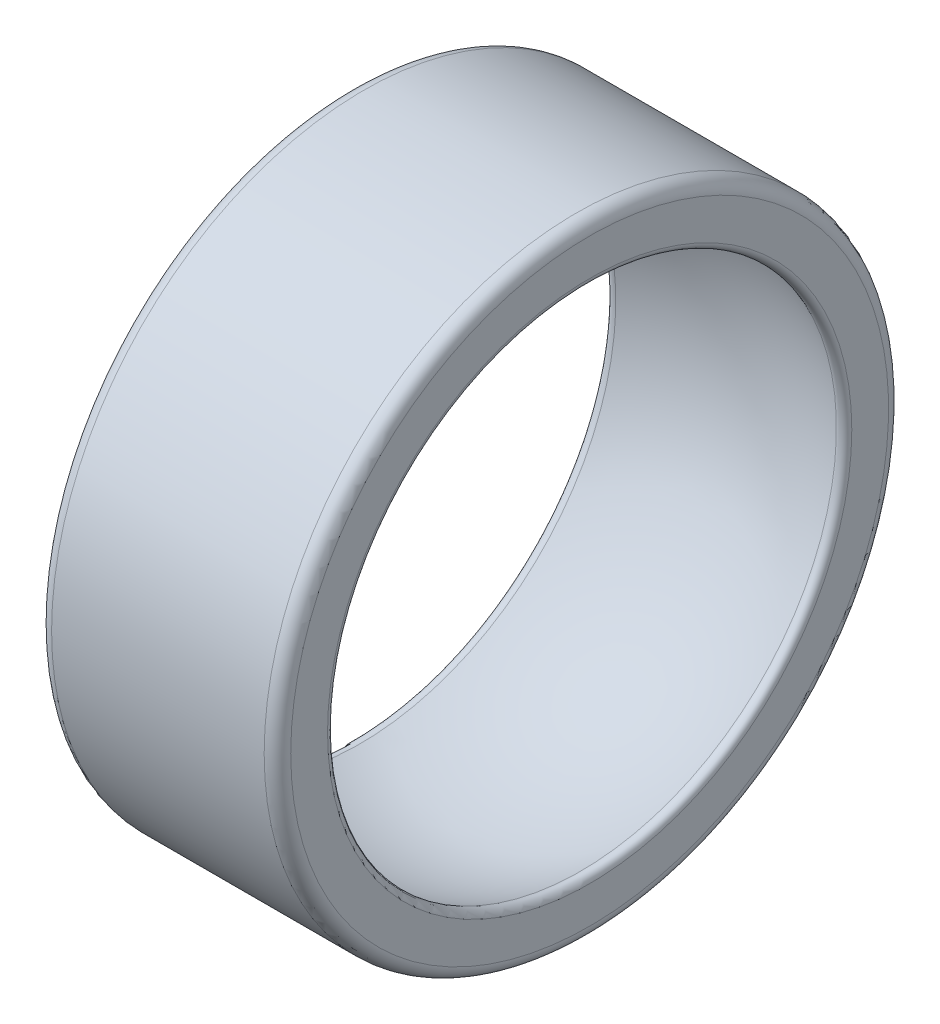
ISO-10303-21;
HEADER;
FILE_DESCRIPTION(('STEP AP214'),'2;1');
FILE_NAME('part.step','',(''),(''),'','','');
FILE_SCHEMA(('AUTOMOTIVE_DESIGN { 1 0 10303 214 1 1 1 1 }'));
ENDSEC;
DATA;
#1=APPLICATION_CONTEXT('core data for automotive mechanical design processes');
#2=APPLICATION_PROTOCOL_DEFINITION('international standard','automotive_design',2000,#1);
#3=PRODUCT_CONTEXT('',#1,'mechanical');
#4=PRODUCT('Part','Part','',(#3));
#5=PRODUCT_RELATED_PRODUCT_CATEGORY('part','',(#4));
#6=PRODUCT_DEFINITION_FORMATION('','',#4);
#7=PRODUCT_DEFINITION_CONTEXT('part definition',#1,'design');
#8=PRODUCT_DEFINITION('design','',#6,#7);
#9=PRODUCT_DEFINITION_SHAPE('','',#8);
#10=(LENGTH_UNIT() NAMED_UNIT(*) SI_UNIT(.MILLI.,.METRE.));
#11=(NAMED_UNIT(*) PLANE_ANGLE_UNIT() SI_UNIT($,.RADIAN.));
#12=(NAMED_UNIT(*) SI_UNIT($,.STERADIAN.) SOLID_ANGLE_UNIT());
#13=UNCERTAINTY_MEASURE_WITH_UNIT(LENGTH_MEASURE(1.E-05),#10,'distance_accuracy_value','');
#14=(GEOMETRIC_REPRESENTATION_CONTEXT(3) GLOBAL_UNCERTAINTY_ASSIGNED_CONTEXT((#13)) GLOBAL_UNIT_ASSIGNED_CONTEXT((#10,
#11,#12)) REPRESENTATION_CONTEXT('',''));
#15=CARTESIAN_POINT('',(0.,0.,0.));
#16=DIRECTION('',(0.,0.,1.));
#17=DIRECTION('',(1.,0.,0.));
#18=AXIS2_PLACEMENT_3D('',#15,#16,#17);
#19=CARTESIAN_POINT('',(1.,0.,0.));
#20=DIRECTION('',(-1.,0.,0.));
#21=DIRECTION('',(0.,0.,1.));
#22=AXIS2_PLACEMENT_3D('',#19,#20,#21);
#23=TOROIDAL_SURFACE('',#22,22.5,1.);
#24=CARTESIAN_POINT('',(0.,0.,0.));
#25=DIRECTION('',(-1.,0.,0.));
#26=DIRECTION('',(0.,0.,1.));
#27=AXIS2_PLACEMENT_3D('',#24,#25,#26);
#28=CIRCLE('',#27,22.5);
#29=CARTESIAN_POINT('',(0.,0.,22.5));
#30=VERTEX_POINT('',#29);
#31=EDGE_CURVE('E10',#30,#30,#28,.T.);
#32=ORIENTED_EDGE('',*,*,#31,.F.);
#33=EDGE_LOOP('',(#32));
#34=FACE_BOUND('',#33,.T.);
#35=CARTESIAN_POINT('',(1.,0.,0.));
#36=DIRECTION('',(-1.,0.,0.));
#37=DIRECTION('',(0.,0.,1.));
#38=AXIS2_PLACEMENT_3D('',#35,#36,#37);
#39=CIRCLE('',#38,23.5);
#40=CARTESIAN_POINT('',(1.,0.,23.5));
#41=VERTEX_POINT('',#40);
#42=EDGE_CURVE('E43',#41,#41,#39,.T.);
#43=ORIENTED_EDGE('',*,*,#42,.T.);
#44=EDGE_LOOP('',(#43));
#45=FACE_BOUND('',#44,.T.);
#46=ADVANCED_FACE('F15',(#34,#45),#23,.T.);
#47=CARTESIAN_POINT('',(0.,22.5,0.));
#48=DIRECTION('',(1.,0.,0.));
#49=DIRECTION('',(0.,0.,-1.));
#50=AXIS2_PLACEMENT_3D('',#47,#48,#49);
#51=PLANE('',#50);
#52=CARTESIAN_POINT('',(0.,0.,0.));
#53=DIRECTION('',(-1.,0.,0.));
#54=DIRECTION('',(0.,0.,1.));
#55=AXIS2_PLACEMENT_3D('',#52,#53,#54);
#56=CIRCLE('',#55,19.73074373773);
#57=CARTESIAN_POINT('',(0.,0.,19.73074373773));
#58=VERTEX_POINT('',#57);
#59=EDGE_CURVE('E21',#58,#58,#56,.T.);
#60=ORIENTED_EDGE('',*,*,#59,.F.);
#61=EDGE_LOOP('',(#60));
#62=FACE_BOUND('',#61,.T.);
#63=ORIENTED_EDGE('',*,*,#31,.T.);
#64=EDGE_LOOP('',(#63));
#65=FACE_BOUND('',#64,.T.);
#66=ADVANCED_FACE('F82',(#62,#65),#51,.F.);
#67=CARTESIAN_POINT('',(0.5,0.,0.));
#68=DIRECTION('',(-1.,0.,0.));
#69=DIRECTION('',(0.,0.,1.));
#70=AXIS2_PLACEMENT_3D('',#67,#68,#69);
#71=TOROIDAL_SURFACE('',#70,19.73074373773,0.5);
#72=CARTESIAN_POINT('',(0.697823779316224,0.,0.));
#73=DIRECTION('',(-1.,0.,0.));
#74=DIRECTION('',(0.,0.,1.));
#75=AXIS2_PLACEMENT_3D('',#72,#73,#74);
#76=CIRCLE('',#75,19.2715425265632);
#77=CARTESIAN_POINT('',(0.697823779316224,0.,19.2715425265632));
#78=VERTEX_POINT('',#77);
#79=EDGE_CURVE('E25',#78,#78,#76,.T.);
#80=ORIENTED_EDGE('',*,*,#79,.F.);
#81=EDGE_LOOP('',(#80));
#82=FACE_BOUND('',#81,.T.);
#83=ORIENTED_EDGE('',*,*,#59,.T.);
#84=EDGE_LOOP('',(#83));
#85=FACE_BOUND('',#84,.T.);
#86=ADVANCED_FACE('F74',(#82,#85),#71,.T.);
#87=CARTESIAN_POINT('',(9.,0.,0.));
#88=DIRECTION('',(0.,0.,1.));
#89=DIRECTION('',(1.,0.,0.));
#90=AXIS2_PLACEMENT_3D('',#87,#88,#89);
#91=SPHERICAL_SURFACE('',#90,20.9837670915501);
#92=CARTESIAN_POINT('',(9.,0.,0.));
#93=DIRECTION('',(-1.,0.,0.));
#94=DIRECTION('',(0.,0.,1.));
#95=AXIS2_PLACEMENT_3D('',#92,#93,#94);
#96=SPHERICAL_SURFACE('',#95,20.9837670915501);
#97=ORIENTED_EDGE('',*,*,#79,.T.);
#98=EDGE_LOOP('',(#97));
#99=FACE_BOUND('',#98,.T.);
#100=CARTESIAN_POINT('',(17.3021762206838,0.,0.));
#101=DIRECTION('',(-1.,0.,0.));
#102=DIRECTION('',(0.,0.,1.));
#103=AXIS2_PLACEMENT_3D('',#100,#101,#102);
#104=CIRCLE('',#103,19.2715425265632);
#105=CARTESIAN_POINT('',(17.3021762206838,0.,19.2715425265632));
#106=VERTEX_POINT('',#105);
#107=EDGE_CURVE('E29',#106,#106,#104,.T.);
#108=ORIENTED_EDGE('',*,*,#107,.F.);
#109=EDGE_LOOP('',(#108));
#110=FACE_BOUND('',#109,.T.);
#111=ADVANCED_FACE('F69',(#99,#110),#96,.F.);
#112=CARTESIAN_POINT('',(17.5,0.,0.));
#113=DIRECTION('',(-1.,0.,0.));
#114=DIRECTION('',(0.,0.,1.));
#115=AXIS2_PLACEMENT_3D('',#112,#113,#114);
#116=TOROIDAL_SURFACE('',#115,19.73074373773,0.5);
#117=CARTESIAN_POINT('',(18.,0.,0.));
#118=DIRECTION('',(-1.,0.,0.));
#119=DIRECTION('',(0.,0.,1.));
#120=AXIS2_PLACEMENT_3D('',#117,#118,#119);
#121=CIRCLE('',#120,19.73074373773);
#122=CARTESIAN_POINT('',(18.,0.,19.73074373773));
#123=VERTEX_POINT('',#122);
#124=EDGE_CURVE('E34',#123,#123,#121,.T.);
#125=ORIENTED_EDGE('',*,*,#124,.F.);
#126=EDGE_LOOP('',(#125));
#127=FACE_BOUND('',#126,.T.);
#128=ORIENTED_EDGE('',*,*,#107,.T.);
#129=EDGE_LOOP('',(#128));
#130=FACE_BOUND('',#129,.T.);
#131=ADVANCED_FACE('F63',(#127,#130),#116,.T.);
#132=CARTESIAN_POINT('',(18.,19.73074373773,0.));
#133=DIRECTION('',(-1.,0.,0.));
#134=DIRECTION('',(0.,0.,1.));
#135=AXIS2_PLACEMENT_3D('',#132,#133,#134);
#136=PLANE('',#135);
#137=CARTESIAN_POINT('',(18.,0.,0.));
#138=DIRECTION('',(-1.,0.,0.));
#139=DIRECTION('',(0.,0.,1.));
#140=AXIS2_PLACEMENT_3D('',#137,#138,#139);
#141=CIRCLE('',#140,22.5);
#142=CARTESIAN_POINT('',(18.,0.,22.5));
#143=VERTEX_POINT('',#142);
#144=EDGE_CURVE('E37',#143,#143,#141,.T.);
#145=ORIENTED_EDGE('',*,*,#144,.F.);
#146=EDGE_LOOP('',(#145));
#147=FACE_BOUND('',#146,.T.);
#148=ORIENTED_EDGE('',*,*,#124,.T.);
#149=EDGE_LOOP('',(#148));
#150=FACE_BOUND('',#149,.T.);
#151=ADVANCED_FACE('F57',(#147,#150),#136,.F.);
#152=CARTESIAN_POINT('',(17.,0.,0.));
#153=DIRECTION('',(-1.,0.,0.));
#154=DIRECTION('',(0.,0.,1.));
#155=AXIS2_PLACEMENT_3D('',#152,#153,#154);
#156=TOROIDAL_SURFACE('',#155,22.5,1.);
#157=CARTESIAN_POINT('',(17.,0.,0.));
#158=DIRECTION('',(-1.,0.,0.));
#159=DIRECTION('',(0.,0.,1.));
#160=AXIS2_PLACEMENT_3D('',#157,#158,#159);
#161=CIRCLE('',#160,23.5);
#162=CARTESIAN_POINT('',(17.,0.,23.5));
#163=VERTEX_POINT('',#162);
#164=EDGE_CURVE('E40',#163,#163,#161,.T.);
#165=ORIENTED_EDGE('',*,*,#164,.F.);
#166=EDGE_LOOP('',(#165));
#167=FACE_BOUND('',#166,.T.);
#168=ORIENTED_EDGE('',*,*,#144,.T.);
#169=EDGE_LOOP('',(#168));
#170=FACE_BOUND('',#169,.T.);
#171=ADVANCED_FACE('F51',(#167,#170),#156,.T.);
#172=CARTESIAN_POINT('',(0.,0.,0.));
#173=DIRECTION('',(-1.,0.,0.));
#174=DIRECTION('',(0.,0.,1.));
#175=AXIS2_PLACEMENT_3D('',#172,#173,#174);
#176=CYLINDRICAL_SURFACE('',#175,23.5);
#177=ORIENTED_EDGE('',*,*,#42,.F.);
#178=EDGE_LOOP('',(#177));
#179=FACE_BOUND('',#178,.T.);
#180=ORIENTED_EDGE('',*,*,#164,.T.);
#181=EDGE_LOOP('',(#180));
#182=FACE_BOUND('',#181,.T.);
#183=ADVANCED_FACE('F48',(#179,#182),#176,.T.);
#184=CLOSED_SHELL('',(#46,#66,#86,#111,#131,#151,#171,#183));
#185=MANIFOLD_SOLID_BREP('B1',#184);
#186=ADVANCED_BREP_SHAPE_REPRESENTATION('',(#18,#185),#14);
#187=SHAPE_DEFINITION_REPRESENTATION(#9,#186);
ENDSEC;
END-ISO-10303-21;
